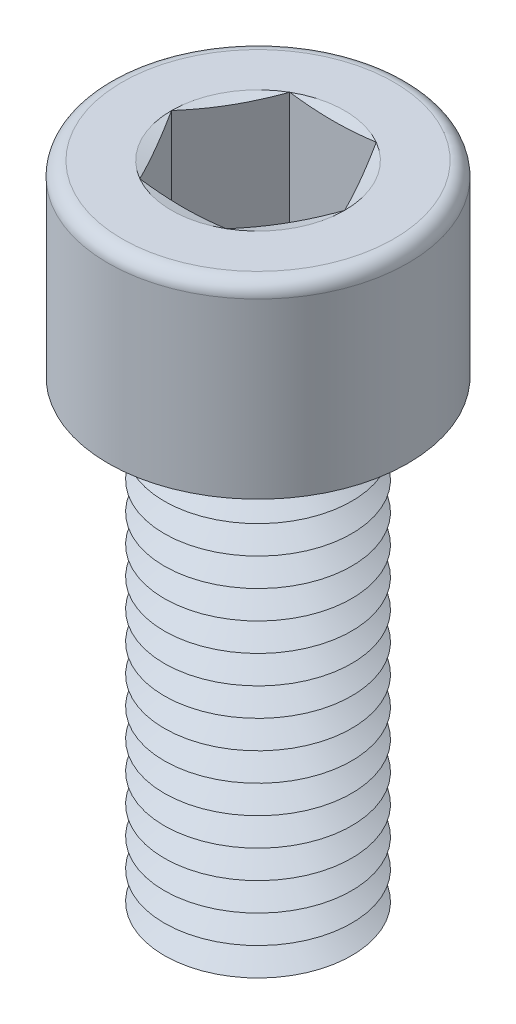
from build123d import *

# Parameters (mm, degrees)
SKETCH1_R       = 5
EXTRUDE1_DEPTH  = 25
SKETCH2_R       = 8
EXTRUDE2_DEPTH  = 10
EXTRUDE3_DEPTH  = 8
FILLET1_R       = 0.75
LPATTERN1_COUNT = 17
LPATTERN1_PITCH = 1.5


with BuildPart() as part:
    # Sketch1 → Extrude1 (new body)
    with BuildSketch(Plane(origin=(0, 0, 0), x_dir=(1, 0, 0), z_dir=(0, 1, 0))):
        with Locations(Location((0, 0, 0), (0, 0, 270))):
            Circle(SKETCH1_R)
    extrude(amount=EXTRUDE1_DEPTH)

    # Sketch2 → Extrude2 (add)
    with BuildSketch(Plane(origin=(0, 25, 0), x_dir=(1, 0, 0), z_dir=(0, 1, 0))):
        with Locations(Location((0, 0, 0), (0, 0, 270))):
            Circle(SKETCH2_R)
    extrude(amount=EXTRUDE2_DEPTH)

    # Sketch3 → Extrude3 (cut)
    with BuildSketch(Plane(origin=(0, 35, 0), x_dir=(1, 0, 0), z_dir=(0, 1, 0))):
        Polygon((2.309401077, 4), (-2.309401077, 4), (-4.618802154, 0), (-2.309401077, -4), (2.309401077, -4), (4.618802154, 0), align=None)
    extrude(amount=-EXTRUDE3_DEPTH, mode=Mode.SUBTRACT)

    # Fillet1
    fillet1_edges = [part.edges().sort_by_distance(p)[0] for p in [
        (0, 35, -8),
    ]]
    fillet(fillet1_edges, radius=FILLET1_R)

    # Sketch4 → Cut-Revolve1 (revolve, cut)
    with BuildSketch(Plane(origin=(0, 0, 0), x_dir=(0, 0, -1), z_dir=(1, 0, 0))):
        Polygon((-4, 27), (0, 27), (0, 24.690598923), align=None)
    revolve(axis=Axis((0, 27, 0), (0, -1, 0)), mode=Mode.SUBTRACT)

    # Sketch5 → Cut-Revolve2 (revolve, cut)
    with BuildSketch(Plane.XY, mode=Mode.PRIVATE) as cut_revolve2_sk:
        Polygon((-5, 0.75), (-5, -0.75), (-3.700961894, 0), align=None)
    cut_revolve2 = revolve(cut_revolve2_sk.sketch.rotate(Axis((0, 25, 0), (0, -1, 0)), 270), axis=Axis((0, 25, 0), (0, -1, 0)), mode=Mode.SUBTRACT)

    # LPattern1: Cut-Revolve2 ×17
    with Locations(*[(0, i * LPATTERN1_PITCH, 0) for i in range(1, LPATTERN1_COUNT)]):
        add(cut_revolve2, mode=Mode.SUBTRACT)

    # Extrude4 cone 1 section (on through the dimple's axis) → Extrude4 (revolve, cut)
    with BuildSketch(Plane(origin=(0, 35, 0), x_dir=(0, 0, 1), z_dir=(1, 0, 0))):
        Polygon((0, 0), (4.618802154, 0), (0, 1.237604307), align=None)
    revolve(axis=Axis((0, 35, 0), (0, -1, 0)), mode=Mode.SUBTRACT)


solid = part.part
